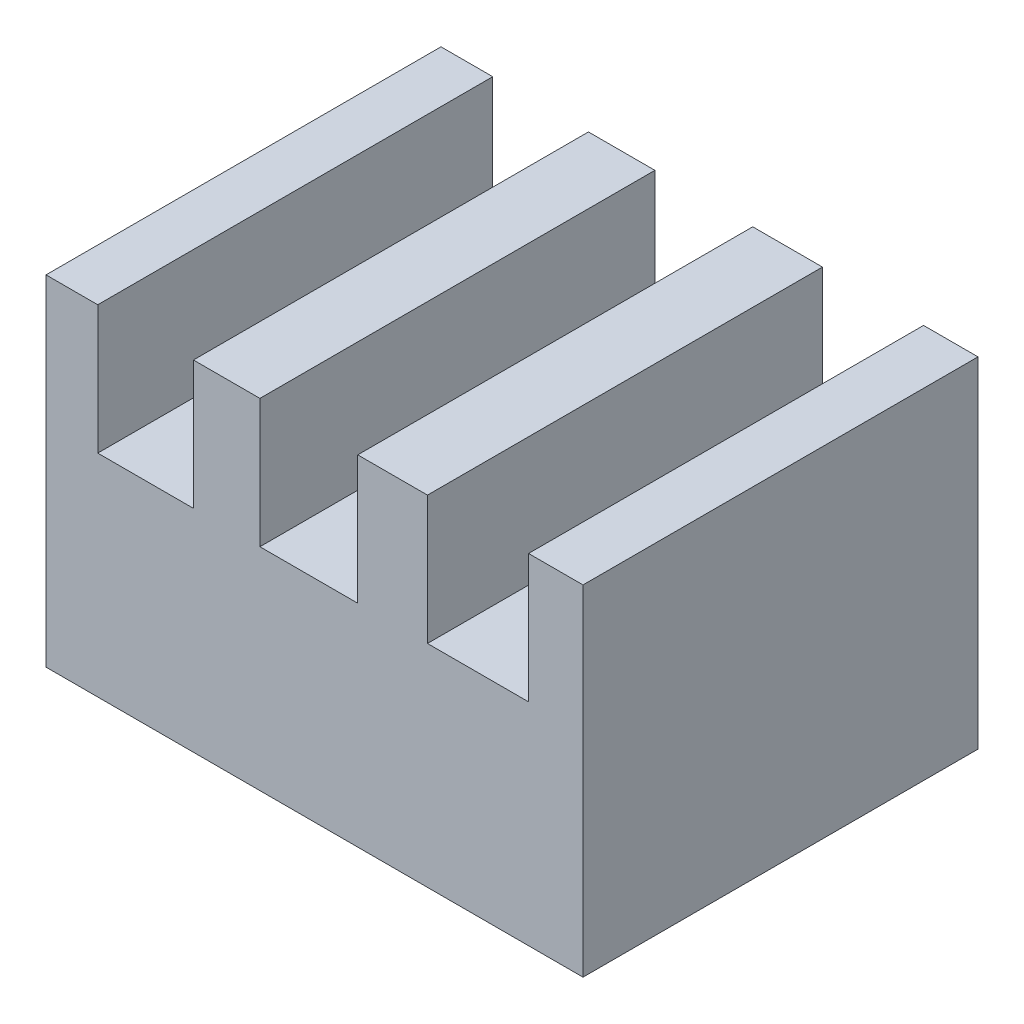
ISO-10303-21;
HEADER;
FILE_DESCRIPTION(('STEP AP214'),'2;1');
FILE_NAME('part.step','',(''),(''),'','','');
FILE_SCHEMA(('AUTOMOTIVE_DESIGN { 1 0 10303 214 1 1 1 1 }'));
ENDSEC;
DATA;
#1=APPLICATION_CONTEXT('core data for automotive mechanical design processes');
#2=APPLICATION_PROTOCOL_DEFINITION('international standard','automotive_design',2000,#1);
#3=PRODUCT_CONTEXT('',#1,'mechanical');
#4=PRODUCT('Part','Part','',(#3));
#5=PRODUCT_RELATED_PRODUCT_CATEGORY('part','',(#4));
#6=PRODUCT_DEFINITION_FORMATION('','',#4);
#7=PRODUCT_DEFINITION_CONTEXT('part definition',#1,'design');
#8=PRODUCT_DEFINITION('design','',#6,#7);
#9=PRODUCT_DEFINITION_SHAPE('','',#8);
#10=(LENGTH_UNIT() NAMED_UNIT(*) SI_UNIT(.MILLI.,.METRE.));
#11=(NAMED_UNIT(*) PLANE_ANGLE_UNIT() SI_UNIT($,.RADIAN.));
#12=(NAMED_UNIT(*) SI_UNIT($,.STERADIAN.) SOLID_ANGLE_UNIT());
#13=UNCERTAINTY_MEASURE_WITH_UNIT(LENGTH_MEASURE(1.E-05),#10,'distance_accuracy_value','');
#14=(GEOMETRIC_REPRESENTATION_CONTEXT(3) GLOBAL_UNCERTAINTY_ASSIGNED_CONTEXT((#13)) GLOBAL_UNIT_ASSIGNED_CONTEXT((#10,
#11,#12)) REPRESENTATION_CONTEXT('',''));
#15=CARTESIAN_POINT('',(0.,0.,0.));
#16=DIRECTION('',(0.,0.,1.));
#17=DIRECTION('',(1.,0.,0.));
#18=AXIS2_PLACEMENT_3D('',#15,#16,#17);
#19=CARTESIAN_POINT('',(0.,33.,0.));
#20=DIRECTION('',(0.,-1.,0.));
#21=DIRECTION('',(0.,0.,-1.));
#22=AXIS2_PLACEMENT_3D('',#19,#20,#21);
#23=PLANE('',#22);
#24=DIRECTION('',(1.,0.,0.));
#25=VECTOR('',#24,1.);
#26=CARTESIAN_POINT('',(1.39101041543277,33.,0.));
#27=LINE('',#26,#25);
#28=CARTESIAN_POINT('',(1.39101041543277,33.,0.));
#29=VERTEX_POINT('',#28);
#30=CARTESIAN_POINT('',(6.41818552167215,33.,0.));
#31=VERTEX_POINT('',#30);
#32=EDGE_CURVE('E217',#29,#31,#27,.T.);
#33=ORIENTED_EDGE('',*,*,#32,.T.);
#34=DIRECTION('',(0.,0.,-1.));
#35=VECTOR('',#34,1.);
#36=CARTESIAN_POINT('',(6.41818552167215,33.,0.));
#37=LINE('',#36,#35);
#38=CARTESIAN_POINT('',(6.41818552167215,33.,-38.3687039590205));
#39=VERTEX_POINT('',#38);
#40=EDGE_CURVE('E162',#31,#39,#37,.T.);
#41=ORIENTED_EDGE('',*,*,#40,.T.);
#42=DIRECTION('',(-1.,0.,0.));
#43=VECTOR('',#42,1.);
#44=CARTESIAN_POINT('',(1.39101041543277,33.,-38.3687039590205));
#45=LINE('',#44,#43);
#46=CARTESIAN_POINT('',(1.39101041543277,33.,-38.3687039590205));
#47=VERTEX_POINT('',#46);
#48=EDGE_CURVE('E222',#39,#47,#45,.T.);
#49=ORIENTED_EDGE('',*,*,#48,.T.);
#50=DIRECTION('',(0.,0.,1.));
#51=VECTOR('',#50,1.);
#52=CARTESIAN_POINT('',(1.39101041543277,33.,0.));
#53=LINE('',#52,#51);
#54=EDGE_CURVE('E212',#47,#29,#53,.T.);
#55=ORIENTED_EDGE('',*,*,#54,.T.);
#56=EDGE_LOOP('',(#33,#41,#49,#55));
#57=FACE_BOUND('',#56,.T.);
#58=ADVANCED_FACE('F33',(#57),#23,.F.);
#59=CARTESIAN_POINT('',(22.1695098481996,33.,-38.3687039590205));
#60=VERTEX_POINT('',#59);
#61=CARTESIAN_POINT('',(15.7114668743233,33.,-38.3687039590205));
#62=VERTEX_POINT('',#61);
#63=EDGE_CURVE('E303',#60,#62,#45,.T.);
#64=ORIENTED_EDGE('',*,*,#63,.T.);
#65=DIRECTION('',(0.,0.,1.));
#66=VECTOR('',#65,1.);
#67=CARTESIAN_POINT('',(15.7114668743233,33.,0.));
#68=LINE('',#67,#66);
#69=CARTESIAN_POINT('',(15.7114668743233,33.,0.));
#70=VERTEX_POINT('',#69);
#71=EDGE_CURVE('E256',#62,#70,#68,.T.);
#72=ORIENTED_EDGE('',*,*,#71,.T.);
#73=CARTESIAN_POINT('',(22.1695098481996,33.,0.));
#74=VERTEX_POINT('',#73);
#75=EDGE_CURVE('E220',#70,#74,#27,.T.);
#76=ORIENTED_EDGE('',*,*,#75,.T.);
#77=DIRECTION('',(0.,0.,-1.));
#78=VECTOR('',#77,1.);
#79=CARTESIAN_POINT('',(22.1695098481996,33.,0.));
#80=LINE('',#79,#78);
#81=EDGE_CURVE('E253',#74,#60,#80,.T.);
#82=ORIENTED_EDGE('',*,*,#81,.T.);
#83=EDGE_LOOP('',(#64,#72,#76,#82));
#84=FACE_BOUND('',#83,.T.);
#85=ADVANCED_FACE('F324',(#84),#23,.F.);
#86=CARTESIAN_POINT('',(38.4458783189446,33.,-38.3687039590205));
#87=VERTEX_POINT('',#86);
#88=CARTESIAN_POINT('',(31.6728088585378,33.,-38.3687039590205));
#89=VERTEX_POINT('',#88);
#90=EDGE_CURVE('E227',#87,#89,#45,.T.);
#91=ORIENTED_EDGE('',*,*,#90,.T.);
#92=DIRECTION('',(0.,0.,1.));
#93=VECTOR('',#92,1.);
#94=CARTESIAN_POINT('',(31.6728088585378,33.,0.));
#95=LINE('',#94,#93);
#96=CARTESIAN_POINT('',(31.6728088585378,33.,0.));
#97=VERTEX_POINT('',#96);
#98=EDGE_CURVE('E251',#89,#97,#95,.T.);
#99=ORIENTED_EDGE('',*,*,#98,.T.);
#100=CARTESIAN_POINT('',(38.4458783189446,33.,0.));
#101=VERTEX_POINT('',#100);
#102=EDGE_CURVE('E281',#97,#101,#27,.T.);
#103=ORIENTED_EDGE('',*,*,#102,.T.);
#104=DIRECTION('',(0.,0.,-1.));
#105=VECTOR('',#104,1.);
#106=CARTESIAN_POINT('',(38.4458783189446,33.,0.));
#107=LINE('',#106,#105);
#108=EDGE_CURVE('E248',#101,#87,#107,.T.);
#109=ORIENTED_EDGE('',*,*,#108,.T.);
#110=EDGE_LOOP('',(#91,#99,#103,#109));
#111=FACE_BOUND('',#110,.T.);
#112=ADVANCED_FACE('F302',(#111),#23,.F.);
#113=CARTESIAN_POINT('',(1.39101041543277,33.,0.));
#114=DIRECTION('',(1.,0.,0.));
#115=DIRECTION('',(0.,0.,-1.));
#116=AXIS2_PLACEMENT_3D('',#113,#114,#115);
#117=PLANE('',#116);
#118=DIRECTION('',(0.,0.,1.));
#119=VECTOR('',#118,1.);
#120=CARTESIAN_POINT('',(1.39101041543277,0.,0.));
#121=LINE('',#120,#119);
#122=CARTESIAN_POINT('',(1.39101041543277,0.,-38.3687039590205));
#123=VERTEX_POINT('',#122);
#124=CARTESIAN_POINT('',(1.39101041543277,0.,0.));
#125=VERTEX_POINT('',#124);
#126=EDGE_CURVE('E211',#123,#125,#121,.T.);
#127=ORIENTED_EDGE('',*,*,#126,.T.);
#128=DIRECTION('',(0.,-1.,0.));
#129=VECTOR('',#128,1.);
#130=CARTESIAN_POINT('',(1.39101041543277,33.,0.));
#131=LINE('',#130,#129);
#132=EDGE_CURVE('E243',#29,#125,#131,.T.);
#133=ORIENTED_EDGE('',*,*,#132,.F.);
#134=ORIENTED_EDGE('',*,*,#54,.F.);
#135=DIRECTION('',(0.,-1.,0.));
#136=VECTOR('',#135,1.);
#137=CARTESIAN_POINT('',(1.39101041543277,33.,-38.3687039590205));
#138=LINE('',#137,#136);
#139=EDGE_CURVE('E226',#47,#123,#138,.T.);
#140=ORIENTED_EDGE('',*,*,#139,.T.);
#141=EDGE_LOOP('',(#127,#133,#134,#140));
#142=FACE_BOUND('',#141,.T.);
#143=ADVANCED_FACE('F35',(#142),#117,.F.);
#144=CARTESIAN_POINT('',(1.39101041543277,33.,0.));
#145=DIRECTION('',(0.,0.,-1.));
#146=DIRECTION('',(-1.,0.,0.));
#147=AXIS2_PLACEMENT_3D('',#144,#145,#146);
#148=PLANE('',#147);
#149=DIRECTION('',(1.,0.,0.));
#150=VECTOR('',#149,1.);
#151=CARTESIAN_POINT('',(6.41818552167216,20.5189427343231,0.));
#152=LINE('',#151,#150);
#153=CARTESIAN_POINT('',(6.41818552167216,20.5189427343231,0.));
#154=VERTEX_POINT('',#153);
#155=CARTESIAN_POINT('',(15.7114668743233,20.5189427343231,0.));
#156=VERTEX_POINT('',#155);
#157=EDGE_CURVE('E151',#154,#156,#152,.T.);
#158=ORIENTED_EDGE('',*,*,#157,.F.);
#159=DIRECTION('',(0.,-1.,0.));
#160=VECTOR('',#159,1.);
#161=CARTESIAN_POINT('',(6.41818552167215,33.,0.));
#162=LINE('',#161,#160);
#163=EDGE_CURVE('E159',#31,#154,#162,.T.);
#164=ORIENTED_EDGE('',*,*,#163,.F.);
#165=ORIENTED_EDGE('',*,*,#32,.F.);
#166=ORIENTED_EDGE('',*,*,#132,.T.);
#167=DIRECTION('',(1.,0.,0.));
#168=VECTOR('',#167,1.);
#169=CARTESIAN_POINT('',(1.39101041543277,0.,0.));
#170=LINE('',#169,#168);
#171=CARTESIAN_POINT('',(53.5539009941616,0.,0.));
#172=VERTEX_POINT('',#171);
#173=EDGE_CURVE('E230',#125,#172,#170,.T.);
#174=ORIENTED_EDGE('',*,*,#173,.T.);
#175=DIRECTION('',(0.,-1.,0.));
#176=VECTOR('',#175,1.);
#177=CARTESIAN_POINT('',(53.5539009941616,33.,0.));
#178=LINE('',#177,#176);
#179=CARTESIAN_POINT('',(53.5539009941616,33.,0.));
#180=VERTEX_POINT('',#179);
#181=EDGE_CURVE('E240',#180,#172,#178,.T.);
#182=ORIENTED_EDGE('',*,*,#181,.F.);
#183=CARTESIAN_POINT('',(48.2642038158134,33.,0.));
#184=VERTEX_POINT('',#183);
#185=EDGE_CURVE('E215',#184,#180,#27,.T.);
#186=ORIENTED_EDGE('',*,*,#185,.F.);
#187=DIRECTION('',(0.,1.,0.));
#188=VECTOR('',#187,1.);
#189=CARTESIAN_POINT('',(48.2642038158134,33.,0.));
#190=LINE('',#189,#188);
#191=CARTESIAN_POINT('',(48.2642038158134,20.5189427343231,0.));
#192=VERTEX_POINT('',#191);
#193=EDGE_CURVE('E48',#192,#184,#190,.T.);
#194=ORIENTED_EDGE('',*,*,#193,.F.);
#195=DIRECTION('',(1.,0.,0.));
#196=VECTOR('',#195,1.);
#197=CARTESIAN_POINT('',(38.4458783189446,20.5189427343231,0.));
#198=LINE('',#197,#196);
#199=CARTESIAN_POINT('',(38.4458783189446,20.5189427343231,0.));
#200=VERTEX_POINT('',#199);
#201=EDGE_CURVE('E188',#200,#192,#198,.T.);
#202=ORIENTED_EDGE('',*,*,#201,.F.);
#203=DIRECTION('',(0.,-1.,0.));
#204=VECTOR('',#203,1.);
#205=CARTESIAN_POINT('',(38.4458783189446,33.,0.));
#206=LINE('',#205,#204);
#207=EDGE_CURVE('E185',#101,#200,#206,.T.);
#208=ORIENTED_EDGE('',*,*,#207,.F.);
#209=ORIENTED_EDGE('',*,*,#102,.F.);
#210=DIRECTION('',(0.,1.,0.));
#211=VECTOR('',#210,1.);
#212=CARTESIAN_POINT('',(31.6728088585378,33.,0.));
#213=LINE('',#212,#211);
#214=CARTESIAN_POINT('',(31.6728088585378,20.5189427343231,0.));
#215=VERTEX_POINT('',#214);
#216=EDGE_CURVE('E56',#215,#97,#213,.T.);
#217=ORIENTED_EDGE('',*,*,#216,.F.);
#218=DIRECTION('',(1.,0.,0.));
#219=VECTOR('',#218,1.);
#220=CARTESIAN_POINT('',(22.1695098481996,20.5189427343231,0.));
#221=LINE('',#220,#219);
#222=CARTESIAN_POINT('',(22.1695098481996,20.5189427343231,0.));
#223=VERTEX_POINT('',#222);
#224=EDGE_CURVE('E177',#223,#215,#221,.T.);
#225=ORIENTED_EDGE('',*,*,#224,.F.);
#226=DIRECTION('',(0.,-1.,0.));
#227=VECTOR('',#226,1.);
#228=CARTESIAN_POINT('',(22.1695098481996,33.,0.));
#229=LINE('',#228,#227);
#230=EDGE_CURVE('E174',#74,#223,#229,.T.);
#231=ORIENTED_EDGE('',*,*,#230,.F.);
#232=ORIENTED_EDGE('',*,*,#75,.F.);
#233=DIRECTION('',(0.,1.,0.));
#234=VECTOR('',#233,1.);
#235=CARTESIAN_POINT('',(15.7114668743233,33.,0.));
#236=LINE('',#235,#234);
#237=EDGE_CURVE('E156',#156,#70,#236,.T.);
#238=ORIENTED_EDGE('',*,*,#237,.F.);
#239=EDGE_LOOP('',(#158,#164,#165,#166,#174,#182,#186,#194,#202,#208,#209,#217,#225,#231,#232,#238));
#240=FACE_BOUND('',#239,.T.);
#241=ADVANCED_FACE('F167',(#240),#148,.F.);
#242=CARTESIAN_POINT('',(53.5539009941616,33.,0.));
#243=DIRECTION('',(-1.,0.,0.));
#244=DIRECTION('',(0.,0.,1.));
#245=AXIS2_PLACEMENT_3D('',#242,#243,#244);
#246=PLANE('',#245);
#247=DIRECTION('',(0.,0.,-1.));
#248=VECTOR('',#247,1.);
#249=CARTESIAN_POINT('',(53.5539009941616,0.,0.));
#250=LINE('',#249,#248);
#251=CARTESIAN_POINT('',(53.5539009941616,0.,-38.3687039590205));
#252=VERTEX_POINT('',#251);
#253=EDGE_CURVE('E232',#172,#252,#250,.T.);
#254=ORIENTED_EDGE('',*,*,#253,.T.);
#255=DIRECTION('',(0.,-1.,0.));
#256=VECTOR('',#255,1.);
#257=CARTESIAN_POINT('',(53.5539009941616,33.,-38.3687039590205));
#258=LINE('',#257,#256);
#259=CARTESIAN_POINT('',(53.5539009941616,33.,-38.3687039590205));
#260=VERTEX_POINT('',#259);
#261=EDGE_CURVE('E237',#260,#252,#258,.T.);
#262=ORIENTED_EDGE('',*,*,#261,.F.);
#263=DIRECTION('',(0.,0.,-1.));
#264=VECTOR('',#263,1.);
#265=CARTESIAN_POINT('',(53.5539009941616,33.,0.));
#266=LINE('',#265,#264);
#267=EDGE_CURVE('E219',#180,#260,#266,.T.);
#268=ORIENTED_EDGE('',*,*,#267,.F.);
#269=ORIENTED_EDGE('',*,*,#181,.T.);
#270=EDGE_LOOP('',(#254,#262,#268,#269));
#271=FACE_BOUND('',#270,.T.);
#272=ADVANCED_FACE('F292',(#271),#246,.F.);
#273=CARTESIAN_POINT('',(1.39101041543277,33.,-38.3687039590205));
#274=DIRECTION('',(0.,0.,1.));
#275=DIRECTION('',(1.,0.,0.));
#276=AXIS2_PLACEMENT_3D('',#273,#274,#275);
#277=PLANE('',#276);
#278=ORIENTED_EDGE('',*,*,#48,.F.);
#279=DIRECTION('',(0.,-1.,0.));
#280=VECTOR('',#279,1.);
#281=CARTESIAN_POINT('',(6.41818552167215,33.,-38.3687039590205));
#282=LINE('',#281,#280);
#283=CARTESIAN_POINT('',(6.41818552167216,20.5189427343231,-38.3687039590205));
#284=VERTEX_POINT('',#283);
#285=EDGE_CURVE('E209',#39,#284,#282,.T.);
#286=ORIENTED_EDGE('',*,*,#285,.T.);
#287=DIRECTION('',(1.,0.,0.));
#288=VECTOR('',#287,1.);
#289=CARTESIAN_POINT('',(1.39101041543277,20.5189427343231,-38.3687039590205));
#290=LINE('',#289,#288);
#291=CARTESIAN_POINT('',(15.7114668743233,20.5189427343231,-38.3687039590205));
#292=VERTEX_POINT('',#291);
#293=EDGE_CURVE('E11',#284,#292,#290,.T.);
#294=ORIENTED_EDGE('',*,*,#293,.T.);
#295=DIRECTION('',(0.,1.,0.));
#296=VECTOR('',#295,1.);
#297=CARTESIAN_POINT('',(15.7114668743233,33.,-38.3687039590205));
#298=LINE('',#297,#296);
#299=EDGE_CURVE('E206',#292,#62,#298,.T.);
#300=ORIENTED_EDGE('',*,*,#299,.T.);
#301=ORIENTED_EDGE('',*,*,#63,.F.);
#302=DIRECTION('',(0.,-1.,0.));
#303=VECTOR('',#302,1.);
#304=CARTESIAN_POINT('',(22.1695098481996,33.,-38.3687039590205));
#305=LINE('',#304,#303);
#306=CARTESIAN_POINT('',(22.1695098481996,20.5189427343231,-38.3687039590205));
#307=VERTEX_POINT('',#306);
#308=EDGE_CURVE('E203',#60,#307,#305,.T.);
#309=ORIENTED_EDGE('',*,*,#308,.T.);
#310=DIRECTION('',(1.,0.,0.));
#311=VECTOR('',#310,1.);
#312=CARTESIAN_POINT('',(1.39101041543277,20.5189427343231,-38.3687039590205));
#313=LINE('',#312,#311);
#314=CARTESIAN_POINT('',(31.6728088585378,20.5189427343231,-38.3687039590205));
#315=VERTEX_POINT('',#314);
#316=EDGE_CURVE('E41',#307,#315,#313,.T.);
#317=ORIENTED_EDGE('',*,*,#316,.T.);
#318=DIRECTION('',(0.,1.,0.));
#319=VECTOR('',#318,1.);
#320=CARTESIAN_POINT('',(31.6728088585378,33.,-38.3687039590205));
#321=LINE('',#320,#319);
#322=EDGE_CURVE('E200',#315,#89,#321,.T.);
#323=ORIENTED_EDGE('',*,*,#322,.T.);
#324=ORIENTED_EDGE('',*,*,#90,.F.);
#325=DIRECTION('',(0.,-1.,0.));
#326=VECTOR('',#325,1.);
#327=CARTESIAN_POINT('',(38.4458783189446,33.,-38.3687039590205));
#328=LINE('',#327,#326);
#329=CARTESIAN_POINT('',(38.4458783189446,20.5189427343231,-38.3687039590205));
#330=VERTEX_POINT('',#329);
#331=EDGE_CURVE('E197',#87,#330,#328,.T.);
#332=ORIENTED_EDGE('',*,*,#331,.T.);
#333=DIRECTION('',(1.,0.,0.));
#334=VECTOR('',#333,1.);
#335=CARTESIAN_POINT('',(1.39101041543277,20.5189427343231,-38.3687039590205));
#336=LINE('',#335,#334);
#337=CARTESIAN_POINT('',(48.2642038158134,20.5189427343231,-38.3687039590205));
#338=VERTEX_POINT('',#337);
#339=EDGE_CURVE('E260',#330,#338,#336,.T.);
#340=ORIENTED_EDGE('',*,*,#339,.T.);
#341=DIRECTION('',(0.,1.,0.));
#342=VECTOR('',#341,1.);
#343=CARTESIAN_POINT('',(48.2642038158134,33.,-38.3687039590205));
#344=LINE('',#343,#342);
#345=CARTESIAN_POINT('',(48.2642038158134,33.,-38.3687039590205));
#346=VERTEX_POINT('',#345);
#347=EDGE_CURVE('E172',#338,#346,#344,.T.);
#348=ORIENTED_EDGE('',*,*,#347,.T.);
#349=EDGE_CURVE('E223',#260,#346,#45,.T.);
#350=ORIENTED_EDGE('',*,*,#349,.F.);
#351=ORIENTED_EDGE('',*,*,#261,.T.);
#352=DIRECTION('',(-1.,0.,0.));
#353=VECTOR('',#352,1.);
#354=CARTESIAN_POINT('',(1.39101041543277,0.,-38.3687039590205));
#355=LINE('',#354,#353);
#356=EDGE_CURVE('E216',#252,#123,#355,.T.);
#357=ORIENTED_EDGE('',*,*,#356,.T.);
#358=ORIENTED_EDGE('',*,*,#139,.F.);
#359=EDGE_LOOP('',(#278,#286,#294,#300,#301,#309,#317,#323,#324,#332,#340,#348,#350,#351,#357,#358));
#360=FACE_BOUND('',#359,.T.);
#361=ADVANCED_FACE('F265',(#360),#277,.F.);
#362=ORIENTED_EDGE('',*,*,#349,.T.);
#363=DIRECTION('',(0.,0.,1.));
#364=VECTOR('',#363,1.);
#365=CARTESIAN_POINT('',(48.2642038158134,33.,0.));
#366=LINE('',#365,#364);
#367=EDGE_CURVE('E246',#346,#184,#366,.T.);
#368=ORIENTED_EDGE('',*,*,#367,.T.);
#369=ORIENTED_EDGE('',*,*,#185,.T.);
#370=ORIENTED_EDGE('',*,*,#267,.T.);
#371=EDGE_LOOP('',(#362,#368,#369,#370));
#372=FACE_BOUND('',#371,.T.);
#373=ADVANCED_FACE('F287',(#372),#23,.F.);
#374=CARTESIAN_POINT('',(0.,0.,0.));
#375=DIRECTION('',(0.,-1.,0.));
#376=DIRECTION('',(0.,0.,-1.));
#377=AXIS2_PLACEMENT_3D('',#374,#375,#376);
#378=PLANE('',#377);
#379=ORIENTED_EDGE('',*,*,#126,.F.);
#380=ORIENTED_EDGE('',*,*,#356,.F.);
#381=ORIENTED_EDGE('',*,*,#253,.F.);
#382=ORIENTED_EDGE('',*,*,#173,.F.);
#383=EDGE_LOOP('',(#379,#380,#381,#382));
#384=FACE_BOUND('',#383,.T.);
#385=ADVANCED_FACE('F313',(#384),#378,.T.);
#386=CARTESIAN_POINT('',(38.4458783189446,20.5189427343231,-43.));
#387=DIRECTION('',(0.,-1.,0.));
#388=DIRECTION('',(0.,0.,-1.));
#389=AXIS2_PLACEMENT_3D('',#386,#387,#388);
#390=PLANE('',#389);
#391=DIRECTION('',(0.,0.,1.));
#392=VECTOR('',#391,1.);
#393=CARTESIAN_POINT('',(38.4458783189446,20.5189427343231,-43.));
#394=LINE('',#393,#392);
#395=EDGE_CURVE('E192',#330,#200,#394,.T.);
#396=ORIENTED_EDGE('',*,*,#395,.T.);
#397=ORIENTED_EDGE('',*,*,#201,.T.);
#398=DIRECTION('',(0.,0.,1.));
#399=VECTOR('',#398,1.);
#400=CARTESIAN_POINT('',(48.2642038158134,20.5189427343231,-43.));
#401=LINE('',#400,#399);
#402=EDGE_CURVE('E178',#338,#192,#401,.T.);
#403=ORIENTED_EDGE('',*,*,#402,.F.);
#404=ORIENTED_EDGE('',*,*,#339,.F.);
#405=EDGE_LOOP('',(#396,#397,#403,#404));
#406=FACE_BOUND('',#405,.T.);
#407=ADVANCED_FACE('F298',(#406),#390,.F.);
#408=CARTESIAN_POINT('',(38.4458783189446,33.,-43.));
#409=DIRECTION('',(-1.,0.,0.));
#410=DIRECTION('',(0.,0.,1.));
#411=AXIS2_PLACEMENT_3D('',#408,#409,#410);
#412=PLANE('',#411);
#413=ORIENTED_EDGE('',*,*,#108,.F.);
#414=ORIENTED_EDGE('',*,*,#207,.T.);
#415=ORIENTED_EDGE('',*,*,#395,.F.);
#416=ORIENTED_EDGE('',*,*,#331,.F.);
#417=EDGE_LOOP('',(#413,#414,#415,#416));
#418=FACE_BOUND('',#417,.T.);
#419=ADVANCED_FACE('F301',(#418),#412,.F.);
#420=CARTESIAN_POINT('',(48.2642038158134,33.,-43.));
#421=DIRECTION('',(1.,0.,0.));
#422=DIRECTION('',(0.,0.,-1.));
#423=AXIS2_PLACEMENT_3D('',#420,#421,#422);
#424=PLANE('',#423);
#425=ORIENTED_EDGE('',*,*,#402,.T.);
#426=ORIENTED_EDGE('',*,*,#193,.T.);
#427=ORIENTED_EDGE('',*,*,#367,.F.);
#428=ORIENTED_EDGE('',*,*,#347,.F.);
#429=EDGE_LOOP('',(#425,#426,#427,#428));
#430=FACE_BOUND('',#429,.T.);
#431=ADVANCED_FACE('F296',(#430),#424,.F.);
#432=CARTESIAN_POINT('',(22.1695098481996,20.5189427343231,-43.));
#433=DIRECTION('',(0.,-1.,0.));
#434=DIRECTION('',(0.,0.,-1.));
#435=AXIS2_PLACEMENT_3D('',#432,#433,#434);
#436=PLANE('',#435);
#437=DIRECTION('',(0.,0.,1.));
#438=VECTOR('',#437,1.);
#439=CARTESIAN_POINT('',(22.1695098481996,20.5189427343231,-43.));
#440=LINE('',#439,#438);
#441=EDGE_CURVE('E182',#307,#223,#440,.T.);
#442=ORIENTED_EDGE('',*,*,#441,.T.);
#443=ORIENTED_EDGE('',*,*,#224,.T.);
#444=DIRECTION('',(0.,0.,1.));
#445=VECTOR('',#444,1.);
#446=CARTESIAN_POINT('',(31.6728088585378,20.5189427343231,-43.));
#447=LINE('',#446,#445);
#448=EDGE_CURVE('E165',#315,#215,#447,.T.);
#449=ORIENTED_EDGE('',*,*,#448,.F.);
#450=ORIENTED_EDGE('',*,*,#316,.F.);
#451=EDGE_LOOP('',(#442,#443,#449,#450));
#452=FACE_BOUND('',#451,.T.);
#453=ADVANCED_FACE('F272',(#452),#436,.F.);
#454=CARTESIAN_POINT('',(22.1695098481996,33.,-43.));
#455=DIRECTION('',(-1.,0.,0.));
#456=DIRECTION('',(0.,0.,1.));
#457=AXIS2_PLACEMENT_3D('',#454,#455,#456);
#458=PLANE('',#457);
#459=ORIENTED_EDGE('',*,*,#81,.F.);
#460=ORIENTED_EDGE('',*,*,#230,.T.);
#461=ORIENTED_EDGE('',*,*,#441,.F.);
#462=ORIENTED_EDGE('',*,*,#308,.F.);
#463=EDGE_LOOP('',(#459,#460,#461,#462));
#464=FACE_BOUND('',#463,.T.);
#465=ADVANCED_FACE('F274',(#464),#458,.F.);
#466=CARTESIAN_POINT('',(31.6728088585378,33.,-43.));
#467=DIRECTION('',(1.,0.,0.));
#468=DIRECTION('',(0.,0.,-1.));
#469=AXIS2_PLACEMENT_3D('',#466,#467,#468);
#470=PLANE('',#469);
#471=ORIENTED_EDGE('',*,*,#448,.T.);
#472=ORIENTED_EDGE('',*,*,#216,.T.);
#473=ORIENTED_EDGE('',*,*,#98,.F.);
#474=ORIENTED_EDGE('',*,*,#322,.F.);
#475=EDGE_LOOP('',(#471,#472,#473,#474));
#476=FACE_BOUND('',#475,.T.);
#477=ADVANCED_FACE('F335',(#476),#470,.F.);
#478=CARTESIAN_POINT('',(6.41818552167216,20.5189427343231,-43.));
#479=DIRECTION('',(0.,-1.,0.));
#480=DIRECTION('',(0.,0.,-1.));
#481=AXIS2_PLACEMENT_3D('',#478,#479,#480);
#482=PLANE('',#481);
#483=DIRECTION('',(0.,0.,1.));
#484=VECTOR('',#483,1.);
#485=CARTESIAN_POINT('',(6.41818552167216,20.5189427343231,-43.));
#486=LINE('',#485,#484);
#487=EDGE_CURVE('E146',#284,#154,#486,.T.);
#488=ORIENTED_EDGE('',*,*,#487,.T.);
#489=ORIENTED_EDGE('',*,*,#157,.T.);
#490=DIRECTION('',(0.,0.,1.));
#491=VECTOR('',#490,1.);
#492=CARTESIAN_POINT('',(15.7114668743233,20.5189427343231,-43.));
#493=LINE('',#492,#491);
#494=EDGE_CURVE('E155',#292,#156,#493,.T.);
#495=ORIENTED_EDGE('',*,*,#494,.F.);
#496=ORIENTED_EDGE('',*,*,#293,.F.);
#497=EDGE_LOOP('',(#488,#489,#495,#496));
#498=FACE_BOUND('',#497,.T.);
#499=ADVANCED_FACE('F148',(#498),#482,.F.);
#500=CARTESIAN_POINT('',(6.41818552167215,33.,-43.));
#501=DIRECTION('',(-1.,0.,0.));
#502=DIRECTION('',(0.,-1.,0.));
#503=AXIS2_PLACEMENT_3D('',#500,#501,#502);
#504=PLANE('',#503);
#505=ORIENTED_EDGE('',*,*,#40,.F.);
#506=ORIENTED_EDGE('',*,*,#163,.T.);
#507=ORIENTED_EDGE('',*,*,#487,.F.);
#508=ORIENTED_EDGE('',*,*,#285,.F.);
#509=EDGE_LOOP('',(#505,#506,#507,#508));
#510=FACE_BOUND('',#509,.T.);
#511=ADVANCED_FACE('F160',(#510),#504,.F.);
#512=CARTESIAN_POINT('',(15.7114668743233,33.,-43.));
#513=DIRECTION('',(1.,0.,0.));
#514=DIRECTION('',(0.,0.,-1.));
#515=AXIS2_PLACEMENT_3D('',#512,#513,#514);
#516=PLANE('',#515);
#517=ORIENTED_EDGE('',*,*,#494,.T.);
#518=ORIENTED_EDGE('',*,*,#237,.T.);
#519=ORIENTED_EDGE('',*,*,#71,.F.);
#520=ORIENTED_EDGE('',*,*,#299,.F.);
#521=EDGE_LOOP('',(#517,#518,#519,#520));
#522=FACE_BOUND('',#521,.T.);
#523=ADVANCED_FACE('F342',(#522),#516,.F.);
#524=CLOSED_SHELL('',(#58,#85,#112,#143,#241,#272,#361,#373,#385,#407,#419,#431,#453,#465,#477,
#499,#511,#523));
#525=MANIFOLD_SOLID_BREP('B2',#524);
#526=ADVANCED_BREP_SHAPE_REPRESENTATION('',(#18,#525),#14);
#527=SHAPE_DEFINITION_REPRESENTATION(#9,#526);
ENDSEC;
END-ISO-10303-21;
